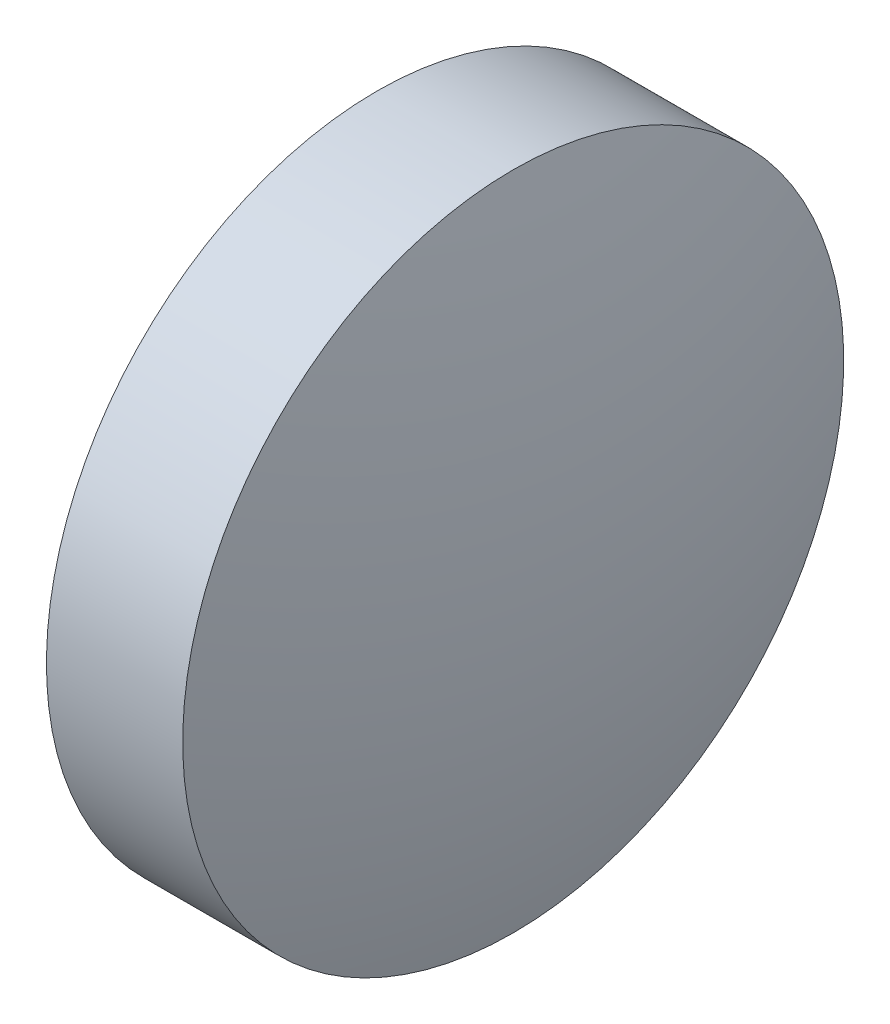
from build123d import *


with BuildPart() as part:
    # Sketch1 → Revolve1 (revolve)
    with BuildSketch(Plane.XY, mode=Mode.PRIVATE) as revolve1_sk:
        with BuildLine():
            Line((0, 0), (0, -24.638))
            Line((0, -24.638), (10.16, -24.638))
            ThreePointArc((10.16, -24.638), (12.740173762, -12.438896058), (13.605794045, 0))
            Line((13.605794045, 0), (0, 0))
        make_face()
    revolve(revolve1_sk.sketch.rotate(Axis((13.605794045, 0, 0), (-1, 0, 0)), 180), axis=Axis((13.605794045, 0, 0), (-1, 0, 0)))


solid = part.part
